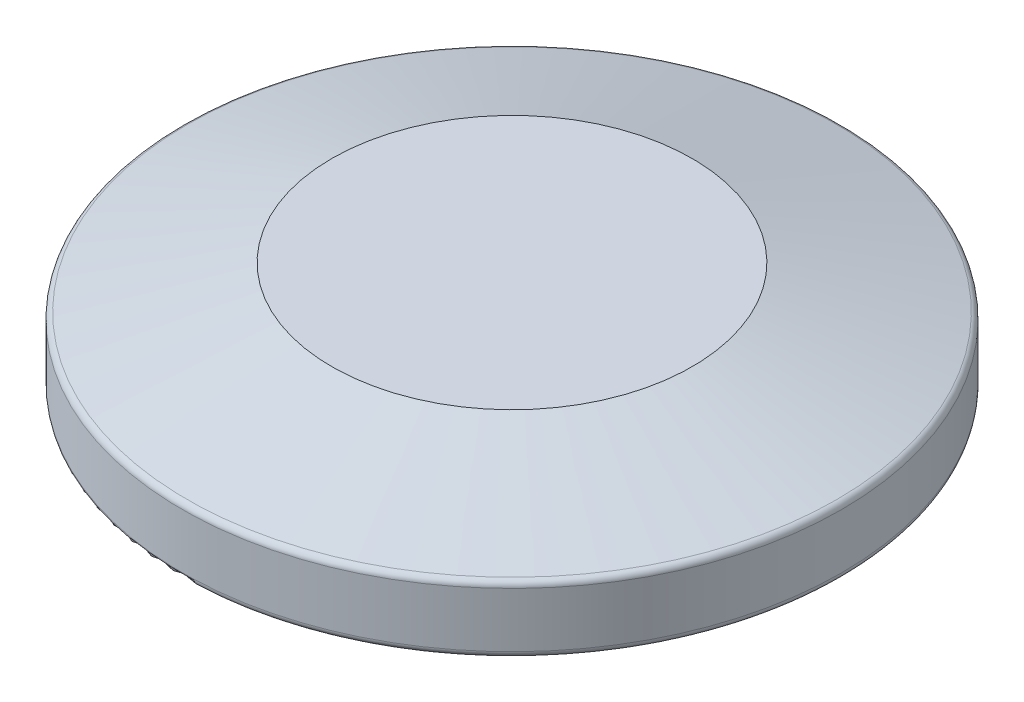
ISO-10303-21;
HEADER;
FILE_DESCRIPTION(('STEP AP214'),'2;1');
FILE_NAME('part.step','',(''),(''),'','','');
FILE_SCHEMA(('AUTOMOTIVE_DESIGN { 1 0 10303 214 1 1 1 1 }'));
ENDSEC;
DATA;
#1=APPLICATION_CONTEXT('core data for automotive mechanical design processes');
#2=APPLICATION_PROTOCOL_DEFINITION('international standard','automotive_design',2000,#1);
#3=PRODUCT_CONTEXT('',#1,'mechanical');
#4=PRODUCT('Part','Part','',(#3));
#5=PRODUCT_RELATED_PRODUCT_CATEGORY('part','',(#4));
#6=PRODUCT_DEFINITION_FORMATION('','',#4);
#7=PRODUCT_DEFINITION_CONTEXT('part definition',#1,'design');
#8=PRODUCT_DEFINITION('design','',#6,#7);
#9=PRODUCT_DEFINITION_SHAPE('','',#8);
#10=(LENGTH_UNIT() NAMED_UNIT(*) SI_UNIT(.MILLI.,.METRE.));
#11=(NAMED_UNIT(*) PLANE_ANGLE_UNIT() SI_UNIT($,.RADIAN.));
#12=(NAMED_UNIT(*) SI_UNIT($,.STERADIAN.) SOLID_ANGLE_UNIT());
#13=UNCERTAINTY_MEASURE_WITH_UNIT(LENGTH_MEASURE(1.E-05),#10,'distance_accuracy_value','');
#14=(GEOMETRIC_REPRESENTATION_CONTEXT(3) GLOBAL_UNCERTAINTY_ASSIGNED_CONTEXT((#13)) GLOBAL_UNIT_ASSIGNED_CONTEXT((#10,
#11,#12)) REPRESENTATION_CONTEXT('',''));
#15=CARTESIAN_POINT('',(0.,0.,0.));
#16=DIRECTION('',(0.,0.,1.));
#17=DIRECTION('',(1.,0.,0.));
#18=AXIS2_PLACEMENT_3D('',#15,#16,#17);
#19=CARTESIAN_POINT('',(0.,0.299999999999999,0.));
#20=DIRECTION('',(0.,1.,0.));
#21=DIRECTION('',(-1.,0.,0.));
#22=AXIS2_PLACEMENT_3D('',#19,#20,#21);
#23=TOROIDAL_SURFACE('',#22,8.95,0.3);
#24=CARTESIAN_POINT('',(0.,0.,0.));
#25=DIRECTION('',(0.,1.,0.));
#26=DIRECTION('',(-1.,0.,0.));
#27=AXIS2_PLACEMENT_3D('',#24,#25,#26);
#28=CIRCLE('',#27,8.95);
#29=CARTESIAN_POINT('',(-8.95,0.,0.));
#30=VERTEX_POINT('',#29);
#31=EDGE_CURVE('E52',#30,#30,#28,.T.);
#32=ORIENTED_EDGE('',*,*,#31,.F.);
#33=EDGE_LOOP('',(#32));
#34=FACE_BOUND('',#33,.T.);
#35=CARTESIAN_POINT('',(0.,0.299999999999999,0.));
#36=DIRECTION('',(0.,1.,0.));
#37=DIRECTION('',(-1.,0.,0.));
#38=AXIS2_PLACEMENT_3D('',#35,#36,#37);
#39=CIRCLE('',#38,8.65);
#40=CARTESIAN_POINT('',(-8.65,0.299999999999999,0.));
#41=VERTEX_POINT('',#40);
#42=EDGE_CURVE('E10',#41,#41,#39,.F.);
#43=ORIENTED_EDGE('',*,*,#42,.F.);
#44=EDGE_LOOP('',(#43));
#45=FACE_BOUND('',#44,.T.);
#46=ADVANCED_FACE('F45',(#34,#45),#23,.T.);
#47=CARTESIAN_POINT('',(0.,0.299999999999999,0.));
#48=DIRECTION('',(0.,1.,0.));
#49=DIRECTION('',(-1.,0.,0.));
#50=AXIS2_PLACEMENT_3D('',#47,#48,#49);
#51=TOROIDAL_SURFACE('',#50,14.6,0.3);
#52=CARTESIAN_POINT('',(0.,0.299999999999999,0.));
#53=DIRECTION('',(0.,1.,0.));
#54=DIRECTION('',(-1.,0.,0.));
#55=AXIS2_PLACEMENT_3D('',#52,#53,#54);
#56=CIRCLE('',#55,14.9);
#57=CARTESIAN_POINT('',(-14.9,0.299999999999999,0.));
#58=VERTEX_POINT('',#57);
#59=EDGE_CURVE('E62',#58,#58,#56,.T.);
#60=ORIENTED_EDGE('',*,*,#59,.F.);
#61=EDGE_LOOP('',(#60));
#62=FACE_BOUND('',#61,.T.);
#63=CARTESIAN_POINT('',(0.,0.,0.));
#64=DIRECTION('',(0.,1.,0.));
#65=DIRECTION('',(-1.,0.,0.));
#66=AXIS2_PLACEMENT_3D('',#63,#64,#65);
#67=CIRCLE('',#66,14.6);
#68=CARTESIAN_POINT('',(-14.6,0.,0.));
#69=VERTEX_POINT('',#68);
#70=EDGE_CURVE('E57',#69,#69,#67,.F.);
#71=ORIENTED_EDGE('',*,*,#70,.F.);
#72=EDGE_LOOP('',(#71));
#73=FACE_BOUND('',#72,.T.);
#74=ADVANCED_FACE('F108',(#62,#73),#51,.T.);
#75=CARTESIAN_POINT('',(0.,2.77599715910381,0.));
#76=DIRECTION('',(0.,-1.,0.));
#77=DIRECTION('',(1.,0.,0.));
#78=AXIS2_PLACEMENT_3D('',#75,#76,#77);
#79=TOROIDAL_SURFACE('',#78,14.6,0.3);
#80=CARTESIAN_POINT('',(0.,3.06363659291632,0.));
#81=DIRECTION('',(0.,1.,0.));
#82=DIRECTION('',(-1.,0.,0.));
#83=AXIS2_PLACEMENT_3D('',#80,#81,#82);
#84=CIRCLE('',#83,14.6852264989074);
#85=CARTESIAN_POINT('',(-14.6852264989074,3.06363659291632,0.));
#86=VERTEX_POINT('',#85);
#87=EDGE_CURVE('E72',#86,#86,#84,.T.);
#88=ORIENTED_EDGE('',*,*,#87,.F.);
#89=EDGE_LOOP('',(#88));
#90=FACE_BOUND('',#89,.T.);
#91=CARTESIAN_POINT('',(0.,2.77599715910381,0.));
#92=DIRECTION('',(0.,-1.,0.));
#93=DIRECTION('',(1.,0.,0.));
#94=AXIS2_PLACEMENT_3D('',#91,#92,#93);
#95=CIRCLE('',#94,14.9);
#96=CARTESIAN_POINT('',(14.9,2.7759971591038,0.));
#97=VERTEX_POINT('',#96);
#98=EDGE_CURVE('E68',#97,#97,#95,.T.);
#99=ORIENTED_EDGE('',*,*,#98,.F.);
#100=EDGE_LOOP('',(#99));
#101=FACE_BOUND('',#100,.T.);
#102=ADVANCED_FACE('F98',(#90,#101),#79,.T.);
#103=CARTESIAN_POINT('',(0.,2.5,0.));
#104=DIRECTION('',(0.,-1.,0.));
#105=DIRECTION('',(1.,0.,0.));
#106=AXIS2_PLACEMENT_3D('',#103,#104,#105);
#107=PLANE('',#106);
#108=CARTESIAN_POINT('',(0.,2.5,0.));
#109=DIRECTION('',(0.,1.,0.));
#110=DIRECTION('',(-1.,0.,0.));
#111=AXIS2_PLACEMENT_3D('',#108,#109,#110);
#112=CIRCLE('',#111,5.35);
#113=CARTESIAN_POINT('',(-5.35,2.5,0.));
#114=VERTEX_POINT('',#113);
#115=EDGE_CURVE('E76',#114,#114,#112,.T.);
#116=ORIENTED_EDGE('',*,*,#115,.T.);
#117=EDGE_LOOP('',(#116));
#118=FACE_BOUND('',#117,.T.);
#119=CARTESIAN_POINT('',(0.,2.5,0.));
#120=DIRECTION('',(0.,1.,0.));
#121=DIRECTION('',(-1.,0.,0.));
#122=AXIS2_PLACEMENT_3D('',#119,#120,#121);
#123=CIRCLE('',#122,8.65);
#124=CARTESIAN_POINT('',(-8.65,2.5,0.));
#125=VERTEX_POINT('',#124);
#126=EDGE_CURVE('E88',#125,#125,#123,.T.);
#127=ORIENTED_EDGE('',*,*,#126,.F.);
#128=EDGE_LOOP('',(#127));
#129=FACE_BOUND('',#128,.T.);
#130=ADVANCED_FACE('F95',(#118,#129),#107,.T.);
#131=CARTESIAN_POINT('',(0.,5.,0.));
#132=DIRECTION('',(0.,1.,0.));
#133=DIRECTION('',(-1.,0.,0.));
#134=AXIS2_PLACEMENT_3D('',#131,#132,#133);
#135=CYLINDRICAL_SURFACE('',#134,5.35);
#136=CARTESIAN_POINT('',(0.,0.,0.));
#137=DIRECTION('',(0.,1.,0.));
#138=DIRECTION('',(-1.,0.,0.));
#139=AXIS2_PLACEMENT_3D('',#136,#137,#138);
#140=CIRCLE('',#139,5.35);
#141=CARTESIAN_POINT('',(-5.35,0.,0.));
#142=VERTEX_POINT('',#141);
#143=EDGE_CURVE('E80',#142,#142,#140,.T.);
#144=ORIENTED_EDGE('',*,*,#143,.T.);
#145=EDGE_LOOP('',(#144));
#146=FACE_BOUND('',#145,.T.);
#147=ORIENTED_EDGE('',*,*,#115,.F.);
#148=EDGE_LOOP('',(#147));
#149=FACE_BOUND('',#148,.T.);
#150=ADVANCED_FACE('F97',(#146,#149),#135,.T.);
#151=CARTESIAN_POINT('',(0.,0.,0.));
#152=DIRECTION('',(0.,1.,0.));
#153=DIRECTION('',(-1.,0.,0.));
#154=AXIS2_PLACEMENT_3D('',#151,#152,#153);
#155=PLANE('',#154);
#156=ORIENTED_EDGE('',*,*,#143,.F.);
#157=EDGE_LOOP('',(#156));
#158=FACE_BOUND('',#157,.T.);
#159=ADVANCED_FACE('F104',(#158),#155,.F.);
#160=CARTESIAN_POINT('',(0.,5.,0.));
#161=DIRECTION('',(0.,-1.,0.));
#162=DIRECTION('',(1.,0.,0.));
#163=AXIS2_PLACEMENT_3D('',#160,#161,#162);
#164=PLANE('',#163);
#165=CARTESIAN_POINT('',(0.,5.,0.));
#166=DIRECTION('',(0.,1.,0.));
#167=DIRECTION('',(-1.,0.,0.));
#168=AXIS2_PLACEMENT_3D('',#165,#166,#167);
#169=CIRCLE('',#168,8.15);
#170=CARTESIAN_POINT('',(-8.15,5.,0.));
#171=VERTEX_POINT('',#170);
#172=EDGE_CURVE('E84',#171,#171,#169,.T.);
#173=ORIENTED_EDGE('',*,*,#172,.T.);
#174=EDGE_LOOP('',(#173));
#175=FACE_BOUND('',#174,.T.);
#176=ADVANCED_FACE('F139',(#175),#164,.F.);
#177=CARTESIAN_POINT('',(0.,3.,0.));
#178=DIRECTION('',(0.,-1.,0.));
#179=DIRECTION('',(1.,0.,0.));
#180=AXIS2_PLACEMENT_3D('',#177,#178,#179);
#181=CONICAL_SURFACE('',#180,14.9,1.28274087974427);
#182=ORIENTED_EDGE('',*,*,#87,.T.);
#183=EDGE_LOOP('',(#182));
#184=FACE_BOUND('',#183,.T.);
#185=ORIENTED_EDGE('',*,*,#172,.F.);
#186=EDGE_LOOP('',(#185));
#187=FACE_BOUND('',#186,.T.);
#188=ADVANCED_FACE('F134',(#184,#187),#181,.T.);
#189=CARTESIAN_POINT('',(0.,5.,0.));
#190=DIRECTION('',(0.,1.,0.));
#191=DIRECTION('',(-1.,0.,0.));
#192=AXIS2_PLACEMENT_3D('',#189,#190,#191);
#193=CYLINDRICAL_SURFACE('',#192,14.9);
#194=ORIENTED_EDGE('',*,*,#59,.T.);
#195=EDGE_LOOP('',(#194));
#196=FACE_BOUND('',#195,.T.);
#197=ORIENTED_EDGE('',*,*,#98,.T.);
#198=EDGE_LOOP('',(#197));
#199=FACE_BOUND('',#198,.T.);
#200=ADVANCED_FACE('F128',(#196,#199),#193,.T.);
#201=CARTESIAN_POINT('',(0.,0.,0.));
#202=DIRECTION('',(0.,1.,0.));
#203=DIRECTION('',(-1.,0.,0.));
#204=AXIS2_PLACEMENT_3D('',#201,#202,#203);
#205=PLANE('',#204);
#206=ORIENTED_EDGE('',*,*,#31,.T.);
#207=EDGE_LOOP('',(#206));
#208=FACE_BOUND('',#207,.T.);
#209=ORIENTED_EDGE('',*,*,#70,.T.);
#210=EDGE_LOOP('',(#209));
#211=FACE_BOUND('',#210,.T.);
#212=ADVANCED_FACE('F127',(#208,#211),#205,.F.);
#213=CARTESIAN_POINT('',(0.,5.,0.));
#214=DIRECTION('',(0.,1.,0.));
#215=DIRECTION('',(-1.,0.,0.));
#216=AXIS2_PLACEMENT_3D('',#213,#214,#215);
#217=CYLINDRICAL_SURFACE('',#216,8.65);
#218=ORIENTED_EDGE('',*,*,#42,.T.);
#219=EDGE_LOOP('',(#218));
#220=FACE_BOUND('',#219,.T.);
#221=ORIENTED_EDGE('',*,*,#126,.T.);
#222=EDGE_LOOP('',(#221));
#223=FACE_BOUND('',#222,.T.);
#224=ADVANCED_FACE('F93',(#220,#223),#217,.F.);
#225=CLOSED_SHELL('',(#46,#74,#102,#130,#150,#159,#176,#188,#200,#212,#224));
#226=MANIFOLD_SOLID_BREP('B2',#225);
#227=ADVANCED_BREP_SHAPE_REPRESENTATION('',(#18,#226),#14);
#228=SHAPE_DEFINITION_REPRESENTATION(#9,#227);
ENDSEC;
END-ISO-10303-21;
